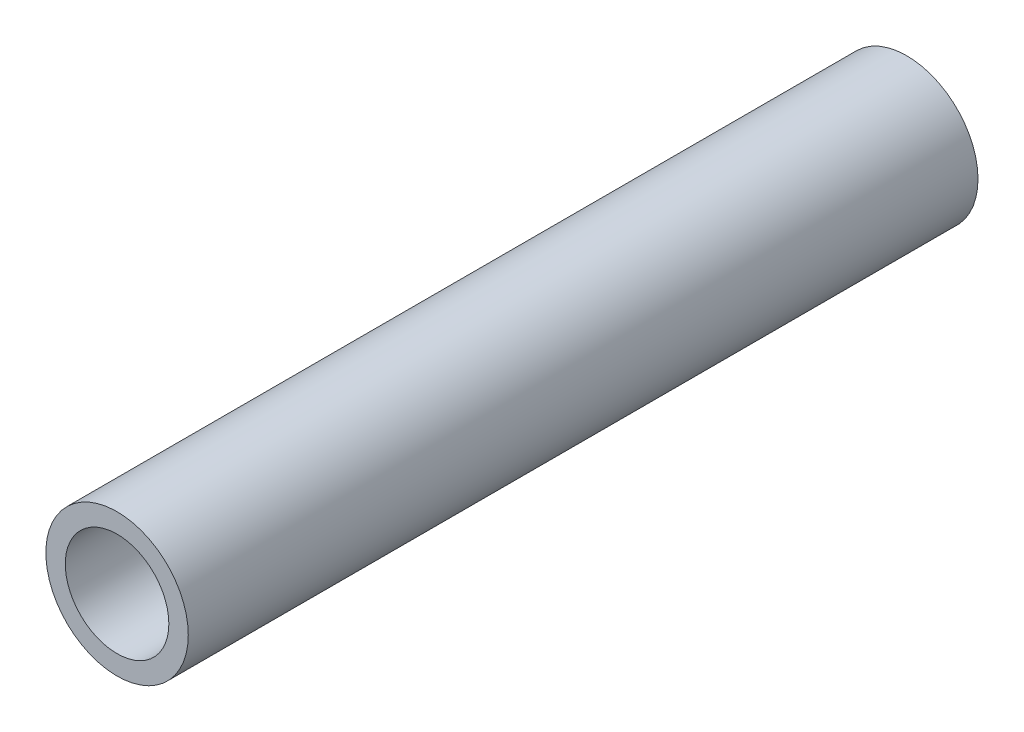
from build123d import *

# Parameters (mm, degrees)
SKETCH1_R           = 27.94
BOSS_EXTRUDE1_DEPTH = 309.88
SKETCH2_R           = 20.32
CUT_EXTRUDE1_DEPTH  = 254
CUT_EXTRUDE2_START  = -50.8
SKETCH3_R           = 20.32
CUT_EXTRUDE2_DEPTH  = 50.8


with BuildPart() as part:
    # Sketch1 → Boss-Extrude1 (new body)
    with BuildSketch(Plane.XY):
        Circle(SKETCH1_R)
    extrude(amount=BOSS_EXTRUDE1_DEPTH)

    # Sketch2 → Cut-Extrude1 (cut)
    with BuildSketch(Plane.XY.offset(309.88)):
        Circle(SKETCH2_R)
    extrude(amount=-CUT_EXTRUDE1_DEPTH, mode=Mode.SUBTRACT)

    # Sketch3 → Cut-Extrude2 (cut)
    with BuildSketch(Plane(origin=(0, 0, 0), x_dir=(-1, 0, 0), z_dir=(0, 0, -1)).offset(CUT_EXTRUDE2_START)):
        with Locations(Location((0, 0, 0), (0, 0, 180))):
            Circle(SKETCH3_R)
    extrude(amount=CUT_EXTRUDE2_DEPTH, mode=Mode.SUBTRACT)


solid = part.part
